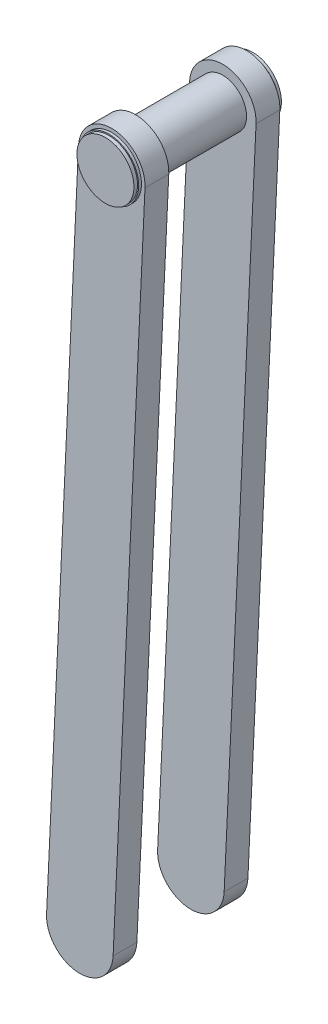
ISO-10303-21;
HEADER;
FILE_DESCRIPTION(('STEP AP214'),'2;1');
FILE_NAME('part.step','',(''),(''),'','','');
FILE_SCHEMA(('AUTOMOTIVE_DESIGN { 1 0 10303 214 1 1 1 1 }'));
ENDSEC;
DATA;
#1=APPLICATION_CONTEXT('core data for automotive mechanical design processes');
#2=APPLICATION_PROTOCOL_DEFINITION('international standard','automotive_design',2000,#1);
#3=PRODUCT_CONTEXT('',#1,'mechanical');
#4=PRODUCT('Part','Part','',(#3));
#5=PRODUCT_RELATED_PRODUCT_CATEGORY('part','',(#4));
#6=PRODUCT_DEFINITION_FORMATION('','',#4);
#7=PRODUCT_DEFINITION_CONTEXT('part definition',#1,'design');
#8=PRODUCT_DEFINITION('design','',#6,#7);
#9=PRODUCT_DEFINITION_SHAPE('','',#8);
#10=(LENGTH_UNIT() NAMED_UNIT(*) SI_UNIT(.MILLI.,.METRE.));
#11=(NAMED_UNIT(*) PLANE_ANGLE_UNIT() SI_UNIT($,.RADIAN.));
#12=(NAMED_UNIT(*) SI_UNIT($,.STERADIAN.) SOLID_ANGLE_UNIT());
#13=UNCERTAINTY_MEASURE_WITH_UNIT(LENGTH_MEASURE(1.E-05),#10,'distance_accuracy_value','');
#14=(GEOMETRIC_REPRESENTATION_CONTEXT(3) GLOBAL_UNCERTAINTY_ASSIGNED_CONTEXT((#13)) GLOBAL_UNIT_ASSIGNED_CONTEXT((#10,
#11,#12)) REPRESENTATION_CONTEXT('',''));
#15=CARTESIAN_POINT('',(0.,0.,0.));
#16=DIRECTION('',(0.,0.,1.));
#17=DIRECTION('',(1.,0.,0.));
#18=AXIS2_PLACEMENT_3D('',#15,#16,#17);
#19=CARTESIAN_POINT('',(-89.8519981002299,502.834128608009,-28.3499999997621));
#20=DIRECTION('',(-0.998905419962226,0.0467756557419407,-1.04322579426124E-12));
#21=DIRECTION('',(-0.0467756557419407,-0.998905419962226,0.));
#22=AXIS2_PLACEMENT_3D('',#19,#20,#21);
#23=PLANE('',#22);
#24=DIRECTION('',(-0.0467756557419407,-0.998905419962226,1.25095821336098E-12));
#25=VECTOR('',#24,1.);
#26=CARTESIAN_POINT('',(-89.8519981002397,502.834128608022,-18.3499999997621));
#27=LINE('',#26,#25);
#28=CARTESIAN_POINT('',(-76.4378578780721,789.296331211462,-18.3500000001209));
#29=VERTEX_POINT('',#28);
#30=CARTESIAN_POINT('',(-89.8519981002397,502.834128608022,-18.3499999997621));
#31=VERTEX_POINT('',#30);
#32=EDGE_CURVE('P0_E83',#29,#31,#27,.T.);
#33=ORIENTED_EDGE('',*,*,#32,.F.);
#34=DIRECTION('',(-9.83569509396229E-13,1.29838651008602E-12,1.));
#35=VECTOR('',#34,1.);
#36=CARTESIAN_POINT('',(-76.4378578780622,789.296331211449,-28.3500000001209));
#37=LINE('',#36,#35);
#38=CARTESIAN_POINT('',(-76.4378578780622,789.296331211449,-28.3500000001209));
#39=VERTEX_POINT('',#38);
#40=EDGE_CURVE('P0_E49',#39,#29,#37,.T.);
#41=ORIENTED_EDGE('',*,*,#40,.F.);
#42=DIRECTION('',(-0.0467756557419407,-0.998905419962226,1.25095821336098E-12));
#43=VECTOR('',#42,1.);
#44=CARTESIAN_POINT('',(-89.8519981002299,502.834128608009,-28.3499999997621));
#45=LINE('',#44,#43);
#46=CARTESIAN_POINT('',(-89.8519981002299,502.834128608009,-28.3499999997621));
#47=VERTEX_POINT('',#46);
#48=EDGE_CURVE('P0_E74',#39,#47,#45,.T.);
#49=ORIENTED_EDGE('',*,*,#48,.T.);
#50=DIRECTION('',(-9.83569509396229E-13,1.29838651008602E-12,1.));
#51=VECTOR('',#50,1.);
#52=CARTESIAN_POINT('',(-89.8519981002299,502.834128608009,-28.3499999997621));
#53=LINE('',#52,#51);
#54=EDGE_CURVE('P0_E11',#47,#31,#53,.T.);
#55=ORIENTED_EDGE('',*,*,#54,.T.);
#56=EDGE_LOOP('',(#33,#41,#49,#55));
#57=FACE_BOUND('',#56,.T.);
#58=ADVANCED_FACE('P0_F16',(#57),#23,.T.);
#59=CARTESIAN_POINT('',(-75.8673222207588,502.179269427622,-28.3499999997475));
#60=DIRECTION('',(-9.83569509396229E-13,1.29838651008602E-12,1.));
#61=DIRECTION('',(0.,-1.,1.29838651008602E-12));
#62=AXIS2_PLACEMENT_3D('',#59,#60,#61);
#63=CYLINDRICAL_SURFACE('',#62,14.);
#64=CARTESIAN_POINT('',(-75.8673222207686,502.179269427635,-18.3499999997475));
#65=DIRECTION('',(-9.83569509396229E-13,1.29838651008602E-12,1.));
#66=DIRECTION('',(0.,1.,-1.29838651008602E-12));
#67=AXIS2_PLACEMENT_3D('',#64,#65,#66);
#68=CIRCLE('',#67,14.);
#69=CARTESIAN_POINT('',(-61.8826463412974,501.524410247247,-18.3499999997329));
#70=VERTEX_POINT('',#69);
#71=EDGE_CURVE('P0_E71',#31,#70,#68,.T.);
#72=ORIENTED_EDGE('',*,*,#71,.F.);
#73=ORIENTED_EDGE('',*,*,#54,.F.);
#74=CARTESIAN_POINT('',(-75.8673222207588,502.179269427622,-28.3499999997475));
#75=DIRECTION('',(-9.83569509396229E-13,1.29838651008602E-12,1.));
#76=DIRECTION('',(0.,1.,-1.29838651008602E-12));
#77=AXIS2_PLACEMENT_3D('',#74,#75,#76);
#78=CIRCLE('',#77,14.);
#79=CARTESIAN_POINT('',(-61.8826463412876,501.524410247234,-28.3499999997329));
#80=VERTEX_POINT('',#79);
#81=EDGE_CURVE('P0_E76',#47,#80,#78,.T.);
#82=ORIENTED_EDGE('',*,*,#81,.T.);
#83=DIRECTION('',(-9.83569509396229E-13,1.29838651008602E-12,1.));
#84=VECTOR('',#83,1.);
#85=CARTESIAN_POINT('',(-61.8826463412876,501.524410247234,-28.3499999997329));
#86=LINE('',#85,#84);
#87=EDGE_CURVE('P0_E20',#80,#70,#86,.T.);
#88=ORIENTED_EDGE('',*,*,#87,.T.);
#89=EDGE_LOOP('',(#72,#73,#82,#88));
#90=FACE_BOUND('',#89,.T.);
#91=ADVANCED_FACE('P0_F90',(#90),#63,.T.);
#92=CARTESIAN_POINT('',(-48.4685061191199,787.986612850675,-28.3500000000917));
#93=DIRECTION('',(0.998905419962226,-0.0467756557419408,1.04322579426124E-12));
#94=DIRECTION('',(0.0467756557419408,0.998905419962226,0.));
#95=AXIS2_PLACEMENT_3D('',#92,#93,#94);
#96=PLANE('',#95);
#97=DIRECTION('',(0.0467756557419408,0.998905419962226,-1.25095821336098E-12));
#98=VECTOR('',#97,1.);
#99=CARTESIAN_POINT('',(-48.4685061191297,787.986612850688,-18.3500000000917));
#100=LINE('',#99,#98);
#101=CARTESIAN_POINT('',(-48.4685061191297,787.986612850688,-18.3500000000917));
#102=VERTEX_POINT('',#101);
#103=EDGE_CURVE('P0_E80',#70,#102,#100,.T.);
#104=ORIENTED_EDGE('',*,*,#103,.F.);
#105=ORIENTED_EDGE('',*,*,#87,.F.);
#106=DIRECTION('',(0.0467756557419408,0.998905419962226,-1.25095821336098E-12));
#107=VECTOR('',#106,1.);
#108=CARTESIAN_POINT('',(-48.4685061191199,787.986612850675,-28.3500000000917));
#109=LINE('',#108,#107);
#110=CARTESIAN_POINT('',(-48.4685061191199,787.986612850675,-28.3500000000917));
#111=VERTEX_POINT('',#110);
#112=EDGE_CURVE('P0_E69',#80,#111,#109,.T.);
#113=ORIENTED_EDGE('',*,*,#112,.T.);
#114=DIRECTION('',(-9.83569509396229E-13,1.29838651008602E-12,1.));
#115=VECTOR('',#114,1.);
#116=CARTESIAN_POINT('',(-48.4685061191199,787.986612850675,-28.3500000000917));
#117=LINE('',#116,#115);
#118=EDGE_CURVE('P0_E61',#111,#102,#117,.T.);
#119=ORIENTED_EDGE('',*,*,#118,.T.);
#120=EDGE_LOOP('',(#104,#105,#113,#119));
#121=FACE_BOUND('',#120,.T.);
#122=ADVANCED_FACE('P0_F18',(#121),#96,.T.);
#123=CARTESIAN_POINT('',(-62.4531819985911,788.641472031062,-28.3500000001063));
#124=DIRECTION('',(-9.83569509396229E-13,1.29838651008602E-12,1.));
#125=DIRECTION('',(0.,-1.,1.29838651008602E-12));
#126=AXIS2_PLACEMENT_3D('',#123,#124,#125);
#127=CYLINDRICAL_SURFACE('',#126,14.);
#128=CARTESIAN_POINT('',(-62.4531819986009,788.641472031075,-18.3500000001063));
#129=DIRECTION('',(-9.83569509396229E-13,1.29838651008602E-12,1.));
#130=DIRECTION('',(0.,1.,-1.29838651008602E-12));
#131=AXIS2_PLACEMENT_3D('',#128,#129,#130);
#132=CIRCLE('',#131,14.);
#133=EDGE_CURVE('P0_E66',#102,#29,#132,.T.);
#134=ORIENTED_EDGE('',*,*,#133,.F.);
#135=ORIENTED_EDGE('',*,*,#118,.F.);
#136=CARTESIAN_POINT('',(-62.4531819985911,788.641472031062,-28.3500000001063));
#137=DIRECTION('',(-9.83569509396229E-13,1.29838651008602E-12,1.));
#138=DIRECTION('',(0.,1.,-1.29838651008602E-12));
#139=AXIS2_PLACEMENT_3D('',#136,#137,#138);
#140=CIRCLE('',#139,14.);
#141=EDGE_CURVE('P0_E64',#111,#39,#140,.T.);
#142=ORIENTED_EDGE('',*,*,#141,.T.);
#143=ORIENTED_EDGE('',*,*,#40,.T.);
#144=EDGE_LOOP('',(#134,#135,#142,#143));
#145=FACE_BOUND('',#144,.T.);
#146=ADVANCED_FACE('P0_F62',(#145),#127,.T.);
#147=CARTESIAN_POINT('',(-69.1602521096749,645.410370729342,-28.3499999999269));
#148=DIRECTION('',(-9.83569623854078E-13,1.29838564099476E-12,1.));
#149=DIRECTION('',(0.,-1.,1.29838564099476E-12));
#150=AXIS2_PLACEMENT_3D('',#147,#148,#149);
#151=PLANE('',#150);
#152=ORIENTED_EDGE('',*,*,#48,.F.);
#153=ORIENTED_EDGE('',*,*,#141,.F.);
#154=ORIENTED_EDGE('',*,*,#112,.F.);
#155=ORIENTED_EDGE('',*,*,#81,.F.);
#156=EDGE_LOOP('',(#152,#153,#154,#155));
#157=FACE_BOUND('',#156,.T.);
#158=ADVANCED_FACE('P0_F73',(#157),#151,.F.);
#159=CARTESIAN_POINT('',(-69.1602521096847,645.410370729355,-18.3499999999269));
#160=DIRECTION('',(-9.83569623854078E-13,1.29838564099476E-12,1.));
#161=DIRECTION('',(0.,-1.,1.29838564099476E-12));
#162=AXIS2_PLACEMENT_3D('',#159,#160,#161);
#163=PLANE('',#162);
#164=ORIENTED_EDGE('',*,*,#32,.T.);
#165=ORIENTED_EDGE('',*,*,#71,.T.);
#166=ORIENTED_EDGE('',*,*,#103,.T.);
#167=ORIENTED_EDGE('',*,*,#133,.T.);
#168=EDGE_LOOP('',(#164,#165,#166,#167));
#169=FACE_BOUND('',#168,.T.);
#170=ADVANCED_FACE('P0_F89',(#169),#163,.T.);
#171=CLOSED_SHELL('',(#58,#91,#122,#146,#158,#170));
#172=MANIFOLD_SOLID_BREP('P0_B1',#171);
#173=CARTESIAN_POINT('',(-62.4531819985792,788.641472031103,29.5022413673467));
#174=DIRECTION('',(-4.13598096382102E-13,0.,1.));
#175=DIRECTION('',(1.,0.,4.13598096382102E-13));
#176=AXIS2_PLACEMENT_3D('',#173,#174,#175);
#177=PLANE('',#176);
#178=CARTESIAN_POINT('',(-62.4531819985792,788.641472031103,29.5022413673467));
#179=DIRECTION('',(4.13598096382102E-13,0.,-1.));
#180=DIRECTION('',(-1.,0.,-4.13598096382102E-13));
#181=AXIS2_PLACEMENT_3D('',#178,#179,#180);
#182=CIRCLE('',#181,12.5000004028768);
#183=CARTESIAN_POINT('',(-74.953182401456,788.641472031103,29.5022413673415));
#184=VERTEX_POINT('',#183);
#185=EDGE_CURVE('P1_E10',#184,#184,#182,.T.);
#186=ORIENTED_EDGE('',*,*,#185,.F.);
#187=EDGE_LOOP('',(#186));
#188=FACE_BOUND('',#187,.T.);
#189=ADVANCED_FACE('P1_F14',(#188),#177,.T.);
#190=CARTESIAN_POINT('',(-62.4531819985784,788.641472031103,27.6499999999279));
#191=DIRECTION('',(4.13598096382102E-13,0.,-1.));
#192=DIRECTION('',(-1.,0.,-4.13598096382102E-13));
#193=AXIS2_PLACEMENT_3D('',#190,#191,#192);
#194=PLANE('',#193);
#195=CARTESIAN_POINT('',(-62.4531819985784,788.641472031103,27.6499999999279));
#196=DIRECTION('',(-4.13598096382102E-13,0.,1.));
#197=DIRECTION('',(1.,0.,4.13598096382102E-13));
#198=AXIS2_PLACEMENT_3D('',#195,#196,#197);
#199=CIRCLE('',#198,12.5000004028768);
#200=CARTESIAN_POINT('',(-49.9531815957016,788.641472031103,27.649999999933));
#201=VERTEX_POINT('',#200);
#202=EDGE_CURVE('P1_E21',#201,#201,#199,.T.);
#203=ORIENTED_EDGE('',*,*,#202,.F.);
#204=EDGE_LOOP('',(#203));
#205=FACE_BOUND('',#204,.T.);
#206=ADVANCED_FACE('P1_F28',(#205),#194,.T.);
#207=CARTESIAN_POINT('',(-62.4531819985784,788.641472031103,27.6499999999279));
#208=DIRECTION('',(-4.13598096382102E-13,0.,1.));
#209=DIRECTION('',(1.,0.,4.13598096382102E-13));
#210=AXIS2_PLACEMENT_3D('',#207,#208,#209);
#211=CYLINDRICAL_SURFACE('',#210,12.5000004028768);
#212=ORIENTED_EDGE('',*,*,#185,.T.);
#213=EDGE_LOOP('',(#212));
#214=FACE_BOUND('',#213,.T.);
#215=ORIENTED_EDGE('',*,*,#202,.T.);
#216=EDGE_LOOP('',(#215));
#217=FACE_BOUND('',#216,.T.);
#218=ADVANCED_FACE('P1_F16',(#214,#217),#211,.T.);
#219=CLOSED_SHELL('',(#189,#206,#218));
#220=MANIFOLD_SOLID_BREP('P1_B1',#219);
#221=CARTESIAN_POINT('',(-62.4531819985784,788.641472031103,29.5022413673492));
#222=DIRECTION('',(0.,0.,-1.));
#223=DIRECTION('',(-1.,0.,0.));
#224=AXIS2_PLACEMENT_3D('',#221,#222,#223);
#225=PLANE('',#224);
#226=CARTESIAN_POINT('',(-62.4531819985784,788.641472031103,29.5022413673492));
#227=DIRECTION('',(0.,0.,1.));
#228=DIRECTION('',(1.,0.,0.));
#229=AXIS2_PLACEMENT_3D('',#226,#227,#228);
#230=CIRCLE('',#229,12.0000004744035);
#231=CARTESIAN_POINT('',(-50.453181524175,788.641472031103,29.5022413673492));
#232=VERTEX_POINT('',#231);
#233=EDGE_CURVE('P2_E10',#232,#232,#230,.T.);
#234=ORIENTED_EDGE('',*,*,#233,.F.);
#235=EDGE_LOOP('',(#234));
#236=FACE_BOUND('',#235,.T.);
#237=ADVANCED_FACE('P2_F14',(#236),#225,.T.);
#238=CARTESIAN_POINT('',(-62.4531819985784,788.641472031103,31.0022413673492));
#239=DIRECTION('',(0.,0.,1.));
#240=DIRECTION('',(1.,0.,0.));
#241=AXIS2_PLACEMENT_3D('',#238,#239,#240);
#242=PLANE('',#241);
#243=CARTESIAN_POINT('',(-62.4531819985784,788.641472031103,31.0022413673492));
#244=DIRECTION('',(0.,0.,-1.));
#245=DIRECTION('',(-1.,0.,0.));
#246=AXIS2_PLACEMENT_3D('',#243,#244,#245);
#247=CIRCLE('',#246,12.0000004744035);
#248=CARTESIAN_POINT('',(-74.4531824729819,788.641472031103,31.0022413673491));
#249=VERTEX_POINT('',#248);
#250=EDGE_CURVE('P2_E21',#249,#249,#247,.T.);
#251=ORIENTED_EDGE('',*,*,#250,.F.);
#252=EDGE_LOOP('',(#251));
#253=FACE_BOUND('',#252,.T.);
#254=ADVANCED_FACE('P2_F28',(#253),#242,.T.);
#255=CARTESIAN_POINT('',(-62.4531819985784,788.641472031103,31.0022413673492));
#256=DIRECTION('',(0.,0.,-1.));
#257=DIRECTION('',(-1.,0.,0.));
#258=AXIS2_PLACEMENT_3D('',#255,#256,#257);
#259=CYLINDRICAL_SURFACE('',#258,12.0000004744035);
#260=ORIENTED_EDGE('',*,*,#233,.T.);
#261=EDGE_LOOP('',(#260));
#262=FACE_BOUND('',#261,.T.);
#263=ORIENTED_EDGE('',*,*,#250,.T.);
#264=EDGE_LOOP('',(#263));
#265=FACE_BOUND('',#264,.T.);
#266=ADVANCED_FACE('P2_F16',(#262,#265),#259,.T.);
#267=CLOSED_SHELL('',(#237,#254,#266));
#268=MANIFOLD_SOLID_BREP('P2_B1',#267);
#269=CARTESIAN_POINT('',(-62.4531819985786,788.641472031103,-27.6500000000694));
#270=DIRECTION('',(-4.13598096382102E-13,0.,1.));
#271=DIRECTION('',(1.,0.,4.13598096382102E-13));
#272=AXIS2_PLACEMENT_3D('',#269,#270,#271);
#273=PLANE('',#272);
#274=CARTESIAN_POINT('',(-62.4531819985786,788.641472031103,-27.6500000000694));
#275=DIRECTION('',(4.13598096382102E-13,0.,-1.));
#276=DIRECTION('',(-1.,0.,-4.13598096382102E-13));
#277=AXIS2_PLACEMENT_3D('',#274,#275,#276);
#278=CIRCLE('',#277,12.500000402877);
#279=CARTESIAN_POINT('',(-74.9531824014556,788.641472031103,-27.6500000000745));
#280=VERTEX_POINT('',#279);
#281=EDGE_CURVE('P3_E10',#280,#280,#278,.T.);
#282=ORIENTED_EDGE('',*,*,#281,.F.);
#283=EDGE_LOOP('',(#282));
#284=FACE_BOUND('',#283,.T.);
#285=ADVANCED_FACE('P3_F15',(#284),#273,.T.);
#286=CARTESIAN_POINT('',(-62.4531819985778,788.641472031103,-29.502241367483));
#287=DIRECTION('',(4.13598096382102E-13,0.,-1.));
#288=DIRECTION('',(-1.,0.,-4.13598096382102E-13));
#289=AXIS2_PLACEMENT_3D('',#286,#287,#288);
#290=PLANE('',#289);
#291=CARTESIAN_POINT('',(-62.4531819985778,788.641472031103,-29.502241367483));
#292=DIRECTION('',(-4.13598096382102E-13,0.,1.));
#293=DIRECTION('',(1.,0.,4.13598096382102E-13));
#294=AXIS2_PLACEMENT_3D('',#291,#292,#293);
#295=CIRCLE('',#294,12.500000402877);
#296=CARTESIAN_POINT('',(-49.9531815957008,788.641472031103,-29.5022413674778));
#297=VERTEX_POINT('',#296);
#298=EDGE_CURVE('P3_E22',#297,#297,#295,.T.);
#299=ORIENTED_EDGE('',*,*,#298,.F.);
#300=EDGE_LOOP('',(#299));
#301=FACE_BOUND('',#300,.T.);
#302=ADVANCED_FACE('P3_F29',(#301),#290,.T.);
#303=CARTESIAN_POINT('',(-62.4531819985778,788.641472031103,-29.502241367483));
#304=DIRECTION('',(-4.13598096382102E-13,0.,1.));
#305=DIRECTION('',(1.,0.,4.13598096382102E-13));
#306=AXIS2_PLACEMENT_3D('',#303,#304,#305);
#307=CYLINDRICAL_SURFACE('',#306,12.500000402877);
#308=ORIENTED_EDGE('',*,*,#281,.T.);
#309=EDGE_LOOP('',(#308));
#310=FACE_BOUND('',#309,.T.);
#311=ORIENTED_EDGE('',*,*,#298,.T.);
#312=EDGE_LOOP('',(#311));
#313=FACE_BOUND('',#312,.T.);
#314=ADVANCED_FACE('P3_F17',(#310,#313),#307,.T.);
#315=CLOSED_SHELL('',(#285,#302,#314));
#316=MANIFOLD_SOLID_BREP('P3_B1',#315);
#317=CARTESIAN_POINT('',(-62.4531819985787,788.641472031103,18.349999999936));
#318=DIRECTION('',(0.,0.,1.));
#319=DIRECTION('',(1.,0.,0.));
#320=AXIS2_PLACEMENT_3D('',#317,#318,#319);
#321=PLANE('',#320);
#322=CARTESIAN_POINT('',(-62.4531819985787,788.641472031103,18.349999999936));
#323=DIRECTION('',(0.,0.,-1.));
#324=DIRECTION('',(-1.,0.,0.));
#325=AXIS2_PLACEMENT_3D('',#322,#323,#324);
#326=CIRCLE('',#325,10.0000004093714);
#327=CARTESIAN_POINT('',(-72.4531824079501,788.641472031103,18.349999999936));
#328=VERTEX_POINT('',#327);
#329=EDGE_CURVE('P4_E10',#328,#328,#326,.T.);
#330=ORIENTED_EDGE('',*,*,#329,.F.);
#331=EDGE_LOOP('',(#330));
#332=FACE_BOUND('',#331,.T.);
#333=ADVANCED_FACE('P4_F14',(#332),#321,.T.);
#334=CARTESIAN_POINT('',(-62.4531819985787,788.641472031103,-18.350000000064));
#335=DIRECTION('',(0.,0.,-1.));
#336=DIRECTION('',(-1.,0.,0.));
#337=AXIS2_PLACEMENT_3D('',#334,#335,#336);
#338=PLANE('',#337);
#339=CARTESIAN_POINT('',(-62.4531819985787,788.641472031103,-18.350000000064));
#340=DIRECTION('',(0.,0.,1.));
#341=DIRECTION('',(1.,0.,0.));
#342=AXIS2_PLACEMENT_3D('',#339,#340,#341);
#343=CIRCLE('',#342,10.0000004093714);
#344=CARTESIAN_POINT('',(-52.4531815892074,788.641472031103,-18.350000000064));
#345=VERTEX_POINT('',#344);
#346=EDGE_CURVE('P4_E21',#345,#345,#343,.T.);
#347=ORIENTED_EDGE('',*,*,#346,.F.);
#348=EDGE_LOOP('',(#347));
#349=FACE_BOUND('',#348,.T.);
#350=ADVANCED_FACE('P4_F28',(#349),#338,.T.);
#351=CARTESIAN_POINT('',(-62.4531819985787,788.641472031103,-18.350000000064));
#352=DIRECTION('',(0.,0.,1.));
#353=DIRECTION('',(1.,0.,0.));
#354=AXIS2_PLACEMENT_3D('',#351,#352,#353);
#355=CYLINDRICAL_SURFACE('',#354,10.0000004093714);
#356=ORIENTED_EDGE('',*,*,#329,.T.);
#357=EDGE_LOOP('',(#356));
#358=FACE_BOUND('',#357,.T.);
#359=ORIENTED_EDGE('',*,*,#346,.T.);
#360=EDGE_LOOP('',(#359));
#361=FACE_BOUND('',#360,.T.);
#362=ADVANCED_FACE('P4_F16',(#358,#361),#355,.T.);
#363=CLOSED_SHELL('',(#333,#350,#362));
#364=MANIFOLD_SOLID_BREP('P4_B1',#363);
#365=CARTESIAN_POINT('',(-61.8826463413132,501.524410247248,18.349999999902));
#366=DIRECTION('',(0.998905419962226,-0.0467756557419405,3.69452405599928E-13));
#367=DIRECTION('',(0.0467756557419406,0.998905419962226,0.));
#368=AXIS2_PLACEMENT_3D('',#365,#366,#367);
#369=PLANE('',#368);
#370=DIRECTION('',(0.0467756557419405,0.998905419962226,0.));
#371=VECTOR('',#370,1.);
#372=CARTESIAN_POINT('',(-61.8826463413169,501.524410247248,28.349999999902));
#373=LINE('',#372,#371);
#374=CARTESIAN_POINT('',(-61.8826463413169,501.524410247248,28.349999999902));
#375=VERTEX_POINT('',#374);
#376=CARTESIAN_POINT('',(-48.4685061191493,787.986612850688,28.3499999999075));
#377=VERTEX_POINT('',#376);
#378=EDGE_CURVE('P5_E83',#375,#377,#373,.T.);
#379=ORIENTED_EDGE('',*,*,#378,.F.);
#380=DIRECTION('',(-3.69952266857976E-13,0.,1.));
#381=VECTOR('',#380,1.);
#382=CARTESIAN_POINT('',(-61.8826463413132,501.524410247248,18.349999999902));
#383=LINE('',#382,#381);
#384=CARTESIAN_POINT('',(-61.8826463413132,501.524410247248,18.349999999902));
#385=VERTEX_POINT('',#384);
#386=EDGE_CURVE('P5_E49',#385,#375,#383,.T.);
#387=ORIENTED_EDGE('',*,*,#386,.F.);
#388=DIRECTION('',(0.0467756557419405,0.998905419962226,0.));
#389=VECTOR('',#388,1.);
#390=CARTESIAN_POINT('',(-61.8826463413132,501.524410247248,18.349999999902));
#391=LINE('',#390,#389);
#392=CARTESIAN_POINT('',(-48.4685061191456,787.986612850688,18.3499999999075));
#393=VERTEX_POINT('',#392);
#394=EDGE_CURVE('P5_E74',#385,#393,#391,.T.);
#395=ORIENTED_EDGE('',*,*,#394,.T.);
#396=DIRECTION('',(-3.69952266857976E-13,0.,1.));
#397=VECTOR('',#396,1.);
#398=CARTESIAN_POINT('',(-48.4685061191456,787.986612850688,18.3499999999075));
#399=LINE('',#398,#397);
#400=EDGE_CURVE('P5_E11',#393,#377,#399,.T.);
#401=ORIENTED_EDGE('',*,*,#400,.T.);
#402=EDGE_LOOP('',(#379,#387,#395,#401));
#403=FACE_BOUND('',#402,.T.);
#404=ADVANCED_FACE('P5_F16',(#403),#369,.T.);
#405=CARTESIAN_POINT('',(-62.4531819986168,788.641472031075,18.3499999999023));
#406=DIRECTION('',(-3.69952266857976E-13,0.,1.));
#407=DIRECTION('',(1.,0.,3.69952266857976E-13));
#408=AXIS2_PLACEMENT_3D('',#405,#406,#407);
#409=CYLINDRICAL_SURFACE('',#408,14.);
#410=CARTESIAN_POINT('',(-62.4531819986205,788.641472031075,28.3499999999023));
#411=DIRECTION('',(-3.69952266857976E-13,0.,1.));
#412=DIRECTION('',(-1.,0.,-3.69952266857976E-13));
#413=AXIS2_PLACEMENT_3D('',#410,#411,#412);
#414=CIRCLE('',#413,14.);
#415=CARTESIAN_POINT('',(-76.4378578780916,789.296331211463,28.3499999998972));
#416=VERTEX_POINT('',#415);
#417=EDGE_CURVE('P5_E71',#377,#416,#414,.T.);
#418=ORIENTED_EDGE('',*,*,#417,.F.);
#419=ORIENTED_EDGE('',*,*,#400,.F.);
#420=CARTESIAN_POINT('',(-62.4531819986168,788.641472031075,18.3499999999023));
#421=DIRECTION('',(-3.69952266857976E-13,0.,1.));
#422=DIRECTION('',(-1.,0.,-3.69952266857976E-13));
#423=AXIS2_PLACEMENT_3D('',#420,#421,#422);
#424=CIRCLE('',#423,14.);
#425=CARTESIAN_POINT('',(-76.4378578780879,789.296331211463,18.3499999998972));
#426=VERTEX_POINT('',#425);
#427=EDGE_CURVE('P5_E76',#393,#426,#424,.T.);
#428=ORIENTED_EDGE('',*,*,#427,.T.);
#429=DIRECTION('',(-3.69952266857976E-13,0.,1.));
#430=VECTOR('',#429,1.);
#431=CARTESIAN_POINT('',(-76.4378578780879,789.296331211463,18.3499999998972));
#432=LINE('',#431,#430);
#433=EDGE_CURVE('P5_E20',#426,#416,#432,.T.);
#434=ORIENTED_EDGE('',*,*,#433,.T.);
#435=EDGE_LOOP('',(#418,#419,#428,#434));
#436=FACE_BOUND('',#435,.T.);
#437=ADVANCED_FACE('P5_F90',(#436),#409,.T.);
#438=CARTESIAN_POINT('',(-76.4378578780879,789.296331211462,18.3499999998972));
#439=DIRECTION('',(-0.998905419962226,0.0467756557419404,-3.69452405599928E-13));
#440=DIRECTION('',(-0.0467756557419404,-0.998905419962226,0.));
#441=AXIS2_PLACEMENT_3D('',#438,#439,#440);
#442=PLANE('',#441);
#443=DIRECTION('',(-0.0467756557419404,-0.998905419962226,0.));
#444=VECTOR('',#443,1.);
#445=CARTESIAN_POINT('',(-76.4378578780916,789.296331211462,28.3499999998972));
#446=LINE('',#445,#444);
#447=CARTESIAN_POINT('',(-89.8519981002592,502.834128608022,28.3499999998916));
#448=VERTEX_POINT('',#447);
#449=EDGE_CURVE('P5_E80',#416,#448,#446,.T.);
#450=ORIENTED_EDGE('',*,*,#449,.F.);
#451=ORIENTED_EDGE('',*,*,#433,.F.);
#452=DIRECTION('',(-0.0467756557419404,-0.998905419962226,0.));
#453=VECTOR('',#452,1.);
#454=CARTESIAN_POINT('',(-76.4378578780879,789.296331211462,18.3499999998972));
#455=LINE('',#454,#453);
#456=CARTESIAN_POINT('',(-89.8519981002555,502.834128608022,18.3499999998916));
#457=VERTEX_POINT('',#456);
#458=EDGE_CURVE('P5_E69',#426,#457,#455,.T.);
#459=ORIENTED_EDGE('',*,*,#458,.T.);
#460=DIRECTION('',(-3.69952266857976E-13,0.,1.));
#461=VECTOR('',#460,1.);
#462=CARTESIAN_POINT('',(-89.8519981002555,502.834128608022,18.3499999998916));
#463=LINE('',#462,#461);
#464=EDGE_CURVE('P5_E61',#457,#448,#463,.T.);
#465=ORIENTED_EDGE('',*,*,#464,.T.);
#466=EDGE_LOOP('',(#450,#451,#459,#465));
#467=FACE_BOUND('',#466,.T.);
#468=ADVANCED_FACE('P5_F18',(#467),#442,.T.);
#469=CARTESIAN_POINT('',(-75.8673222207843,502.179269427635,18.3499999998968));
#470=DIRECTION('',(-3.69952266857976E-13,0.,1.));
#471=DIRECTION('',(1.,0.,3.69952266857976E-13));
#472=AXIS2_PLACEMENT_3D('',#469,#470,#471);
#473=CYLINDRICAL_SURFACE('',#472,14.);
#474=CARTESIAN_POINT('',(-75.867322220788,502.179269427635,28.3499999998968));
#475=DIRECTION('',(-3.69952266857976E-13,0.,1.));
#476=DIRECTION('',(-1.,0.,-3.69952266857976E-13));
#477=AXIS2_PLACEMENT_3D('',#474,#475,#476);
#478=CIRCLE('',#477,14.);
#479=EDGE_CURVE('P5_E66',#448,#375,#478,.T.);
#480=ORIENTED_EDGE('',*,*,#479,.F.);
#481=ORIENTED_EDGE('',*,*,#464,.F.);
#482=CARTESIAN_POINT('',(-75.8673222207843,502.179269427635,18.3499999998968));
#483=DIRECTION('',(-3.69952266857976E-13,0.,1.));
#484=DIRECTION('',(-1.,0.,-3.69952266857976E-13));
#485=AXIS2_PLACEMENT_3D('',#482,#483,#484);
#486=CIRCLE('',#485,14.);
#487=EDGE_CURVE('P5_E64',#457,#385,#486,.T.);
#488=ORIENTED_EDGE('',*,*,#487,.T.);
#489=ORIENTED_EDGE('',*,*,#386,.T.);
#490=EDGE_LOOP('',(#480,#481,#488,#489));
#491=FACE_BOUND('',#490,.T.);
#492=ADVANCED_FACE('P5_F62',(#491),#473,.T.);
#493=CARTESIAN_POINT('',(-69.1602521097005,645.410370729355,18.3499999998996));
#494=DIRECTION('',(-3.69952300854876E-13,0.,1.));
#495=DIRECTION('',(1.,0.,3.69952300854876E-13));
#496=AXIS2_PLACEMENT_3D('',#493,#494,#495);
#497=PLANE('',#496);
#498=ORIENTED_EDGE('',*,*,#394,.F.);
#499=ORIENTED_EDGE('',*,*,#487,.F.);
#500=ORIENTED_EDGE('',*,*,#458,.F.);
#501=ORIENTED_EDGE('',*,*,#427,.F.);
#502=EDGE_LOOP('',(#498,#499,#500,#501));
#503=FACE_BOUND('',#502,.T.);
#504=ADVANCED_FACE('P5_F73',(#503),#497,.F.);
#505=CARTESIAN_POINT('',(-69.1602521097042,645.410370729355,28.3499999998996));
#506=DIRECTION('',(-3.69952300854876E-13,0.,1.));
#507=DIRECTION('',(1.,0.,3.69952300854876E-13));
#508=AXIS2_PLACEMENT_3D('',#505,#506,#507);
#509=PLANE('',#508);
#510=ORIENTED_EDGE('',*,*,#378,.T.);
#511=ORIENTED_EDGE('',*,*,#417,.T.);
#512=ORIENTED_EDGE('',*,*,#449,.T.);
#513=ORIENTED_EDGE('',*,*,#479,.T.);
#514=EDGE_LOOP('',(#510,#511,#512,#513));
#515=FACE_BOUND('',#514,.T.);
#516=ADVANCED_FACE('P5_F89',(#515),#509,.T.);
#517=CLOSED_SHELL('',(#404,#437,#468,#492,#504,#516));
#518=MANIFOLD_SOLID_BREP('P5_B1',#517);
#519=CARTESIAN_POINT('',(-62.4531819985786,788.641472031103,-31.0022413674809));
#520=DIRECTION('',(0.,0.,-1.));
#521=DIRECTION('',(-1.,0.,0.));
#522=AXIS2_PLACEMENT_3D('',#519,#520,#521);
#523=PLANE('',#522);
#524=CARTESIAN_POINT('',(-62.4531819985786,788.641472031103,-31.0022413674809));
#525=DIRECTION('',(0.,0.,1.));
#526=DIRECTION('',(1.,0.,0.));
#527=AXIS2_PLACEMENT_3D('',#524,#525,#526);
#528=CIRCLE('',#527,12.0000004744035);
#529=CARTESIAN_POINT('',(-50.4531815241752,788.641472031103,-31.0022413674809));
#530=VERTEX_POINT('',#529);
#531=EDGE_CURVE('P6_E10',#530,#530,#528,.T.);
#532=ORIENTED_EDGE('',*,*,#531,.F.);
#533=EDGE_LOOP('',(#532));
#534=FACE_BOUND('',#533,.T.);
#535=ADVANCED_FACE('P6_F14',(#534),#523,.T.);
#536=CARTESIAN_POINT('',(-62.4531819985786,788.641472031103,-29.5022413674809));
#537=DIRECTION('',(0.,0.,1.));
#538=DIRECTION('',(1.,0.,0.));
#539=AXIS2_PLACEMENT_3D('',#536,#537,#538);
#540=PLANE('',#539);
#541=CARTESIAN_POINT('',(-62.4531819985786,788.641472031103,-29.5022413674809));
#542=DIRECTION('',(0.,0.,-1.));
#543=DIRECTION('',(-1.,0.,0.));
#544=AXIS2_PLACEMENT_3D('',#541,#542,#543);
#545=CIRCLE('',#544,12.0000004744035);
#546=CARTESIAN_POINT('',(-74.4531824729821,788.641472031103,-29.5022413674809));
#547=VERTEX_POINT('',#546);
#548=EDGE_CURVE('P6_E21',#547,#547,#545,.T.);
#549=ORIENTED_EDGE('',*,*,#548,.F.);
#550=EDGE_LOOP('',(#549));
#551=FACE_BOUND('',#550,.T.);
#552=ADVANCED_FACE('P6_F28',(#551),#540,.T.);
#553=CARTESIAN_POINT('',(-62.4531819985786,788.641472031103,-29.5022413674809));
#554=DIRECTION('',(0.,0.,-1.));
#555=DIRECTION('',(-1.,0.,0.));
#556=AXIS2_PLACEMENT_3D('',#553,#554,#555);
#557=CYLINDRICAL_SURFACE('',#556,12.0000004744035);
#558=ORIENTED_EDGE('',*,*,#531,.T.);
#559=EDGE_LOOP('',(#558));
#560=FACE_BOUND('',#559,.T.);
#561=ORIENTED_EDGE('',*,*,#548,.T.);
#562=EDGE_LOOP('',(#561));
#563=FACE_BOUND('',#562,.T.);
#564=ADVANCED_FACE('P6_F16',(#560,#563),#557,.T.);
#565=CLOSED_SHELL('',(#535,#552,#564));
#566=MANIFOLD_SOLID_BREP('P6_B1',#565);
#567=ADVANCED_BREP_SHAPE_REPRESENTATION('',(#18,#172,#220,#268,#316,#364,#518,#566),#14);
#568=SHAPE_DEFINITION_REPRESENTATION(#9,#567);
ENDSEC;
END-ISO-10303-21;
